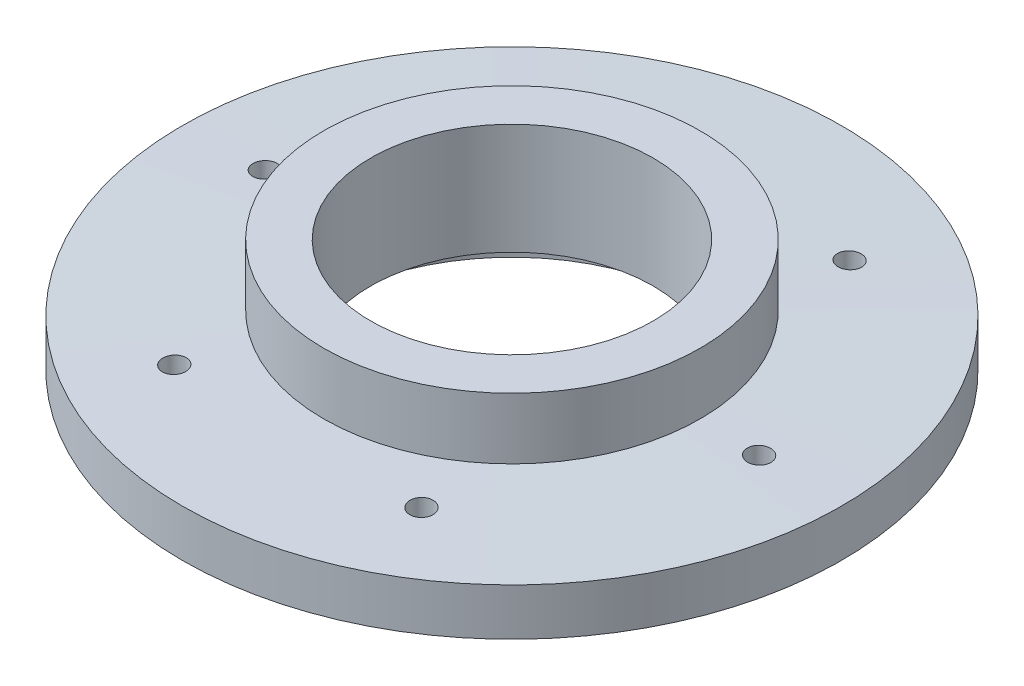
from build123d import *

# Parameters (mm, degrees)
PER_AGE1_D  = 12
ESQUISSE4_W = 3.139683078
ESQUISSE4_H = 0.5
ESQUISSE5_W = 0.5
ESQUISSE5_H = 3.139683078
ESQUISSE6_W = 3.139683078
ESQUISSE6_H = 0.5
ESQUISSE7_W = 0.5
ESQUISSE7_H = 3.139683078
ESQUISSE8_W = 3.139683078
ESQUISSE8_H = 0.5
ESQUISSE9_W = 3.139683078
ESQUISSE9_H = 0.5


with BuildPart() as part:
    # Esquisse1 → R_volution1 (revolve)
    with BuildSketch(Plane(origin=(0, 0, 0), x_dir=(-1, 0, 0), z_dir=(0, 0, -1)), mode=Mode.PRIVATE) as r_volution1_sk:
        Polygon((-8, 1.6), (0, 1.6), (0, 6.309524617), (-8, 6.309524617), (-8, 3.709524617), (-14, 3.5), (-14, 1.5), (-8, 0), align=None)
    revolve(r_volution1_sk.sketch.rotate(Axis((0, 0, 0), (0, 1, 0)), 270), axis=Axis((0, 0, 0), (0, 1, 0)))

    # Per_age1 (through all)
    with Locations(Plane.XZ.offset(-1.6)):
        with Locations((0, 0)):
            Hole(PER_AGE1_D / 2)

    # Esquisse4 → Enl_vement de mati_re-R_volution1 (revolve, cut)
    with BuildSketch(Plane(origin=(0, 0, 0), x_dir=(0, 1, 0), z_dir=(0.8660254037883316, 0, 0.4999999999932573)), mode=Mode.PRIVATE) as enl_vement_de_mati_re_r_volution1_sk:
        with Locations((2.069841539, 10.25)):
            Rectangle(ESQUISSE4_W, ESQUISSE4_H)
    revolve(enl_vement_de_mati_re_r_volution1_sk.sketch.rotate(Axis((-5.25, 3.639683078, 9.09326674), (0, -1, 0)), 284.779523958), axis=Axis((-5.25, 3.639683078, 9.09326674), (0, -1, 0)), mode=Mode.SUBTRACT)

    # Esquisse5 → Enl_vement de mati_re-R_volution2 (revolve, cut)
    with BuildSketch(Plane.XY, mode=Mode.PRIVATE) as enl_vement_de_mati_re_r_volution2_sk:
        with Locations((-10.25, 2.069841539)):
            Rectangle(ESQUISSE5_W, ESQUISSE5_H)
    revolve(enl_vement_de_mati_re_r_volution2_sk.sketch.rotate(Axis((-10.5, 3.639683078, 0), (0, -1, 0)), 226.705131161), axis=Axis((-10.5, 3.639683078, 0), (0, -1, 0)), mode=Mode.SUBTRACT)

    # Esquisse6 → Enl_vement de mati_re-R_volution3 (revolve, cut)
    with BuildSketch(Plane(origin=(0, 0, 0), x_dir=(0, 1, 0), z_dir=(0.8660254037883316, 0, 0.4999999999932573)), mode=Mode.PRIVATE) as enl_vement_de_mati_re_r_volution3_sk:
        with Locations((2.069841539, -10.25)):
            Rectangle(ESQUISSE6_W, ESQUISSE6_H)
    revolve(enl_vement_de_mati_re_r_volution3_sk.sketch.rotate(Axis((5.25, 0.5, -9.09326674), (0, 1, 0)), 255.904400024), axis=Axis((5.25, 0.5, -9.09326674), (0, 1, 0)), mode=Mode.SUBTRACT)

    # Esquisse7 → Enl_vement de mati_re-R_volution4 (revolve, cut)
    with BuildSketch(Plane.XY, mode=Mode.PRIVATE) as enl_vement_de_mati_re_r_volution4_sk:
        with Locations((10.25, 2.069841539)):
            Rectangle(ESQUISSE7_W, ESQUISSE7_H)
    revolve(enl_vement_de_mati_re_r_volution4_sk.sketch.rotate(Axis((10.5, 0.5, 0), (0, 1, 0)), 314.811166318), axis=Axis((10.5, 0.5, 0), (0, 1, 0)), mode=Mode.SUBTRACT)

    # Esquisse8 → Enl_vement de mati_re-R_volution5 (revolve, cut)
    with BuildSketch(Plane(origin=(0, 0, 0), x_dir=(0, 1, 0), z_dir=(0.8660254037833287, 0, -0.5000000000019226)), mode=Mode.PRIVATE) as enl_vement_de_mati_re_r_volution5_sk:
        with Locations((2.069841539, 10.75)):
            Rectangle(ESQUISSE8_W, ESQUISSE8_H)
    revolve(enl_vement_de_mati_re_r_volution5_sk.sketch.rotate(Axis((5.25, 0.5, 9.09326674), (0, 1, 0)), 195.937201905), axis=Axis((5.25, 0.5, 9.09326674), (0, 1, 0)), mode=Mode.SUBTRACT)

    # Esquisse9 → Enl_vement de mati_re-R_volution6 (revolve, cut)
    with BuildSketch(Plane(origin=(2.616320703, 0, -4.24487637), x_dir=(0, -1, 0), z_dir=(-0.5246920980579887, 0, 0.8512920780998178)), mode=Mode.PRIVATE) as enl_vement_de_mati_re_r_volution6_sk:
        with Locations((-2.069841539, -8.990448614)):
            Rectangle(ESQUISSE9_W, ESQUISSE9_H)
    revolve(enl_vement_de_mati_re_r_volution6_sk.sketch.rotate(Axis((-5.25, 3.639683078, -9.09326674), (0, -1, 0)), 193.387531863), axis=Axis((-5.25, 3.639683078, -9.09326674), (0, -1, 0)), mode=Mode.SUBTRACT)


solid = part.part
